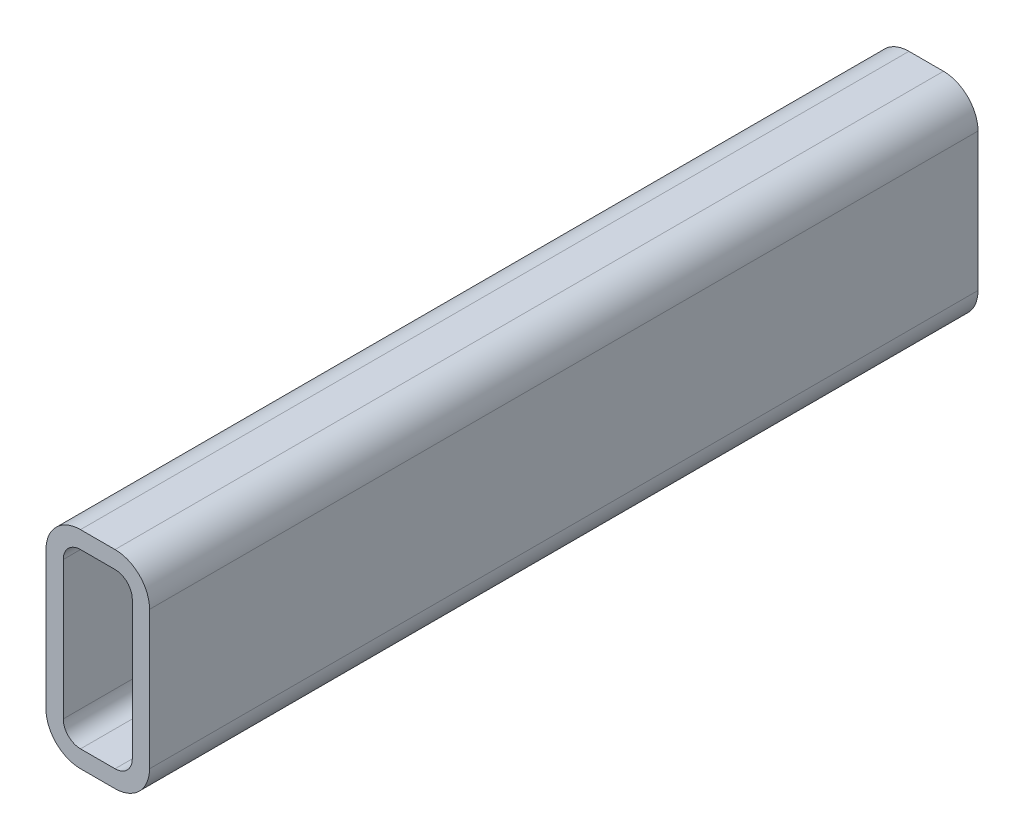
from build123d import *

# Parameters (mm, degrees)
BOSS_EXTRUDE1_DEPTH = 304.8


with BuildPart() as part:
    # Sketch1 → Boss-Extrude1 (new body)
    with BuildSketch(Plane.XY):
        with BuildLine():
            Line((12.7, 76.2), (25.4, 76.2))
            ThreePointArc((25.4, 76.2), (34.380256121, 72.480256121), (38.1, 63.5))
            Line((38.1, 63.5), (38.1, 12.7))
            ThreePointArc((38.1, 12.7), (34.380256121, 3.719743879), (25.4, 0))
            Line((25.4, 0), (12.7, 0))
            ThreePointArc((12.7, 0), (3.719743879, 3.719743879), (0, 12.7))
            Line((0, 12.7), (0, 63.5))
            ThreePointArc((0, 63.5), (3.719743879, 72.480256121), (12.7, 76.2))
        make_face()
        with BuildLine():
            Line((12.7, 69.85), (25.4, 69.85))
            ThreePointArc((25.4, 69.85), (29.890128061, 67.990128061), (31.75, 63.5))
            Line((31.75, 63.5), (31.75, 12.7))
            ThreePointArc((31.75, 12.7), (29.890128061, 8.209871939), (25.4, 6.35))
            Line((25.4, 6.35), (12.7, 6.35))
            ThreePointArc((12.7, 6.35), (8.209871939, 8.209871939), (6.35, 12.7))
            Line((6.35, 12.7), (6.35, 63.5))
            ThreePointArc((6.35, 63.5), (8.209871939, 67.990128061), (12.7, 69.85))
        make_face(mode=Mode.SUBTRACT)
    extrude(amount=BOSS_EXTRUDE1_DEPTH)


solid = part.part
